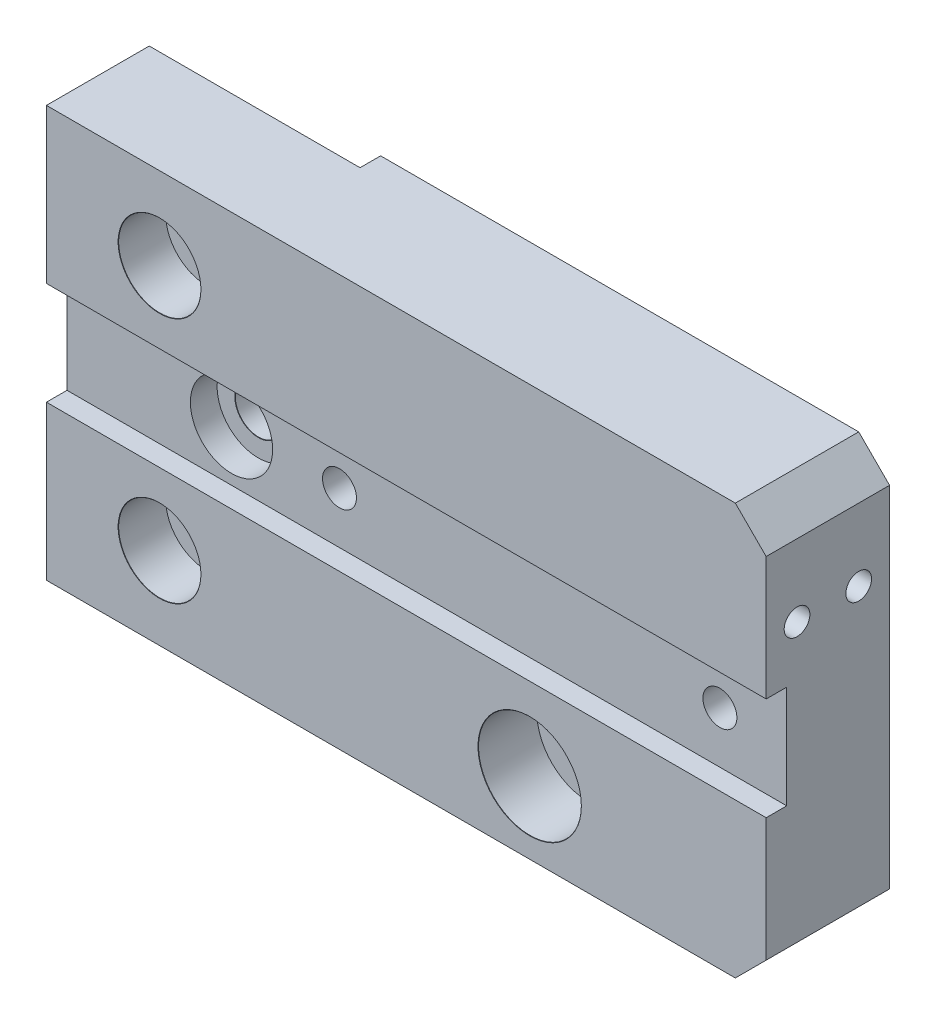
ISO-10303-21;
HEADER;
FILE_DESCRIPTION(('STEP AP214'),'2;1');
FILE_NAME('part.step','',(''),(''),'','','');
FILE_SCHEMA(('AUTOMOTIVE_DESIGN { 1 0 10303 214 1 1 1 1 }'));
ENDSEC;
DATA;
#1=APPLICATION_CONTEXT('core data for automotive mechanical design processes');
#2=APPLICATION_PROTOCOL_DEFINITION('international standard','automotive_design',2000,#1);
#3=PRODUCT_CONTEXT('',#1,'mechanical');
#4=PRODUCT('Part','Part','',(#3));
#5=PRODUCT_RELATED_PRODUCT_CATEGORY('part','',(#4));
#6=PRODUCT_DEFINITION_FORMATION('','',#4);
#7=PRODUCT_DEFINITION_CONTEXT('part definition',#1,'design');
#8=PRODUCT_DEFINITION('design','',#6,#7);
#9=PRODUCT_DEFINITION_SHAPE('','',#8);
#10=(LENGTH_UNIT() NAMED_UNIT(*) SI_UNIT(.MILLI.,.METRE.));
#11=(NAMED_UNIT(*) PLANE_ANGLE_UNIT() SI_UNIT($,.RADIAN.));
#12=(NAMED_UNIT(*) SI_UNIT($,.STERADIAN.) SOLID_ANGLE_UNIT());
#13=UNCERTAINTY_MEASURE_WITH_UNIT(LENGTH_MEASURE(1.E-05),#10,'distance_accuracy_value','');
#14=(GEOMETRIC_REPRESENTATION_CONTEXT(3) GLOBAL_UNCERTAINTY_ASSIGNED_CONTEXT((#13)) GLOBAL_UNIT_ASSIGNED_CONTEXT((#10,
#11,#12)) REPRESENTATION_CONTEXT('',''));
#15=CARTESIAN_POINT('',(0.,0.,0.));
#16=DIRECTION('',(0.,0.,1.));
#17=DIRECTION('',(1.,0.,0.));
#18=AXIS2_PLACEMENT_3D('',#15,#16,#17);
#19=CARTESIAN_POINT('',(0.,0.,12.));
#20=DIRECTION('',(0.,0.,-1.));
#21=DIRECTION('',(-1.,0.,0.));
#22=AXIS2_PLACEMENT_3D('',#19,#20,#21);
#23=PLANE('',#22);
#24=CARTESIAN_POINT('',(6.5,12.,12.));
#25=DIRECTION('',(0.,0.,1.));
#26=DIRECTION('',(1.,0.,0.));
#27=AXIS2_PLACEMENT_3D('',#24,#25,#26);
#28=CIRCLE('',#27,4.025);
#29=CARTESIAN_POINT('',(10.525,12.,12.));
#30=VERTEX_POINT('',#29);
#31=EDGE_CURVE('E229',#30,#30,#28,.T.);
#32=ORIENTED_EDGE('',*,*,#31,.F.);
#33=EDGE_LOOP('',(#32));
#34=FACE_BOUND('',#33,.T.);
#35=DIRECTION('',(0.,1.,0.));
#36=VECTOR('',#35,1.);
#37=CARTESIAN_POINT('',(65.5,-20.,12.));
#38=LINE('',#37,#36);
#39=CARTESIAN_POINT('',(65.5,5.,12.));
#40=VERTEX_POINT('',#39);
#41=CARTESIAN_POINT('',(65.5,17.,12.));
#42=VERTEX_POINT('',#41);
#43=EDGE_CURVE('E272',#40,#42,#38,.T.);
#44=ORIENTED_EDGE('',*,*,#43,.T.);
#45=DIRECTION('',(0.707106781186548,-0.707106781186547,0.));
#46=VECTOR('',#45,1.);
#47=CARTESIAN_POINT('',(62.5,20.,12.));
#48=LINE('',#47,#46);
#49=CARTESIAN_POINT('',(62.5,20.,12.));
#50=VERTEX_POINT('',#49);
#51=EDGE_CURVE('E303',#42,#50,#48,.F.);
#52=ORIENTED_EDGE('',*,*,#51,.T.);
#53=DIRECTION('',(-1.,0.,0.));
#54=VECTOR('',#53,1.);
#55=CARTESIAN_POINT('',(-4.5,20.,12.));
#56=LINE('',#55,#54);
#57=CARTESIAN_POINT('',(-4.5,20.,12.));
#58=VERTEX_POINT('',#57);
#59=EDGE_CURVE('E275',#50,#58,#56,.T.);
#60=ORIENTED_EDGE('',*,*,#59,.T.);
#61=DIRECTION('',(0.,-1.,0.));
#62=VECTOR('',#61,1.);
#63=CARTESIAN_POINT('',(-4.5,-20.,12.));
#64=LINE('',#63,#62);
#65=CARTESIAN_POINT('',(-4.5,5.,12.));
#66=VERTEX_POINT('',#65);
#67=EDGE_CURVE('E266',#58,#66,#64,.T.);
#68=ORIENTED_EDGE('',*,*,#67,.T.);
#69=DIRECTION('',(1.,0.,0.));
#70=VECTOR('',#69,1.);
#71=CARTESIAN_POINT('',(-4.5,5.,12.));
#72=LINE('',#71,#70);
#73=EDGE_CURVE('E159',#66,#40,#72,.T.);
#74=ORIENTED_EDGE('',*,*,#73,.T.);
#75=EDGE_LOOP('',(#44,#52,#60,#68,#74));
#76=FACE_BOUND('',#75,.T.);
#77=ADVANCED_FACE('F16',(#34,#76),#23,.F.);
#78=CARTESIAN_POINT('',(-4.5,-20.,12.));
#79=DIRECTION('',(1.,0.,0.));
#80=DIRECTION('',(0.,0.,-1.));
#81=AXIS2_PLACEMENT_3D('',#78,#79,#80);
#82=PLANE('',#81);
#83=DIRECTION('',(0.,1.,0.));
#84=VECTOR('',#83,1.);
#85=CARTESIAN_POINT('',(-4.5,5.,10.));
#86=LINE('',#85,#84);
#87=CARTESIAN_POINT('',(-4.5,-5.,10.));
#88=VERTEX_POINT('',#87);
#89=CARTESIAN_POINT('',(-4.5,5.,10.));
#90=VERTEX_POINT('',#89);
#91=EDGE_CURVE('E145',#88,#90,#86,.T.);
#92=ORIENTED_EDGE('',*,*,#91,.T.);
#93=DIRECTION('',(0.,0.,1.));
#94=VECTOR('',#93,1.);
#95=CARTESIAN_POINT('',(-4.5,5.,12.));
#96=LINE('',#95,#94);
#97=EDGE_CURVE('E149',#90,#66,#96,.T.);
#98=ORIENTED_EDGE('',*,*,#97,.T.);
#99=ORIENTED_EDGE('',*,*,#67,.F.);
#100=DIRECTION('',(0.,0.,-1.));
#101=VECTOR('',#100,1.);
#102=CARTESIAN_POINT('',(-4.5,20.,12.));
#103=LINE('',#102,#101);
#104=CARTESIAN_POINT('',(-4.5,20.,2.));
#105=VERTEX_POINT('',#104);
#106=EDGE_CURVE('E277',#58,#105,#103,.T.);
#107=ORIENTED_EDGE('',*,*,#106,.T.);
#108=DIRECTION('',(0.,-1.,0.));
#109=VECTOR('',#108,1.);
#110=CARTESIAN_POINT('',(-4.5,20.,2.));
#111=LINE('',#110,#109);
#112=CARTESIAN_POINT('',(-4.5,-20.,2.));
#113=VERTEX_POINT('',#112);
#114=EDGE_CURVE('E259',#105,#113,#111,.T.);
#115=ORIENTED_EDGE('',*,*,#114,.T.);
#116=DIRECTION('',(0.,0.,-1.));
#117=VECTOR('',#116,1.);
#118=CARTESIAN_POINT('',(-4.5,-20.,12.));
#119=LINE('',#118,#117);
#120=CARTESIAN_POINT('',(-4.5,-20.,12.));
#121=VERTEX_POINT('',#120);
#122=EDGE_CURVE('E286',#121,#113,#119,.T.);
#123=ORIENTED_EDGE('',*,*,#122,.F.);
#124=CARTESIAN_POINT('',(-4.5,-5.,12.));
#125=VERTEX_POINT('',#124);
#126=EDGE_CURVE('E270',#125,#121,#64,.T.);
#127=ORIENTED_EDGE('',*,*,#126,.F.);
#128=DIRECTION('',(0.,0.,-1.));
#129=VECTOR('',#128,1.);
#130=CARTESIAN_POINT('',(-4.5,-5.,12.));
#131=LINE('',#130,#129);
#132=EDGE_CURVE('E142',#125,#88,#131,.T.);
#133=ORIENTED_EDGE('',*,*,#132,.T.);
#134=EDGE_LOOP('',(#92,#98,#99,#107,#115,#123,#127,#133));
#135=FACE_BOUND('',#134,.T.);
#136=ADVANCED_FACE('F337',(#135),#82,.F.);
#137=CARTESIAN_POINT('',(-4.5,-20.,12.));
#138=DIRECTION('',(0.,1.,0.));
#139=DIRECTION('',(0.,0.,1.));
#140=AXIS2_PLACEMENT_3D('',#137,#138,#139);
#141=PLANE('',#140);
#142=DIRECTION('',(1.,0.,0.));
#143=VECTOR('',#142,1.);
#144=CARTESIAN_POINT('',(-4.5,-20.,0.));
#145=LINE('',#144,#143);
#146=CARTESIAN_POINT('',(16.,-20.,0.));
#147=VERTEX_POINT('',#146);
#148=CARTESIAN_POINT('',(62.5,-20.,0.));
#149=VERTEX_POINT('',#148);
#150=EDGE_CURVE('E262',#147,#149,#145,.T.);
#151=ORIENTED_EDGE('',*,*,#150,.T.);
#152=DIRECTION('',(0.,0.,1.));
#153=VECTOR('',#152,1.);
#154=CARTESIAN_POINT('',(62.5,-20.,12.));
#155=LINE('',#154,#153);
#156=CARTESIAN_POINT('',(62.5,-20.,12.));
#157=VERTEX_POINT('',#156);
#158=EDGE_CURVE('E24',#149,#157,#155,.T.);
#159=ORIENTED_EDGE('',*,*,#158,.T.);
#160=DIRECTION('',(1.,0.,0.));
#161=VECTOR('',#160,1.);
#162=CARTESIAN_POINT('',(-4.5,-20.,12.));
#163=LINE('',#162,#161);
#164=EDGE_CURVE('E269',#121,#157,#163,.T.);
#165=ORIENTED_EDGE('',*,*,#164,.F.);
#166=ORIENTED_EDGE('',*,*,#122,.T.);
#167=DIRECTION('',(-1.,0.,0.));
#168=VECTOR('',#167,1.);
#169=CARTESIAN_POINT('',(-4.5,-20.,2.));
#170=LINE('',#169,#168);
#171=CARTESIAN_POINT('',(16.,-20.,2.));
#172=VERTEX_POINT('',#171);
#173=EDGE_CURVE('E252',#172,#113,#170,.T.);
#174=ORIENTED_EDGE('',*,*,#173,.F.);
#175=DIRECTION('',(0.,0.,1.));
#176=VECTOR('',#175,1.);
#177=CARTESIAN_POINT('',(16.,-20.,0.));
#178=LINE('',#177,#176);
#179=EDGE_CURVE('E247',#147,#172,#178,.T.);
#180=ORIENTED_EDGE('',*,*,#179,.F.);
#181=EDGE_LOOP('',(#151,#159,#165,#166,#174,#180));
#182=FACE_BOUND('',#181,.T.);
#183=ADVANCED_FACE('F329',(#182),#141,.F.);
#184=CARTESIAN_POINT('',(65.5,-20.,12.));
#185=DIRECTION('',(-1.,0.,0.));
#186=DIRECTION('',(0.,0.,1.));
#187=AXIS2_PLACEMENT_3D('',#184,#185,#186);
#188=PLANE('',#187);
#189=CARTESIAN_POINT('',(65.5,10.,3.));
#190=DIRECTION('',(1.,0.,0.));
#191=DIRECTION('',(0.,0.,-1.));
#192=AXIS2_PLACEMENT_3D('',#189,#190,#191);
#193=CIRCLE('',#192,1.25);
#194=CARTESIAN_POINT('',(65.5,10.,1.75));
#195=VERTEX_POINT('',#194);
#196=EDGE_CURVE('E119',#195,#195,#193,.T.);
#197=ORIENTED_EDGE('',*,*,#196,.F.);
#198=EDGE_LOOP('',(#197));
#199=FACE_BOUND('',#198,.T.);
#200=CARTESIAN_POINT('',(65.5,10.,9.));
#201=DIRECTION('',(1.,0.,0.));
#202=DIRECTION('',(0.,0.,-1.));
#203=AXIS2_PLACEMENT_3D('',#200,#201,#202);
#204=CIRCLE('',#203,1.25);
#205=CARTESIAN_POINT('',(65.5,10.,7.75));
#206=VERTEX_POINT('',#205);
#207=EDGE_CURVE('E118',#206,#206,#204,.T.);
#208=ORIENTED_EDGE('',*,*,#207,.F.);
#209=EDGE_LOOP('',(#208));
#210=FACE_BOUND('',#209,.T.);
#211=DIRECTION('',(0.,1.,0.));
#212=VECTOR('',#211,1.);
#213=CARTESIAN_POINT('',(65.5,-20.,0.));
#214=LINE('',#213,#212);
#215=CARTESIAN_POINT('',(65.5,-17.,0.));
#216=VERTEX_POINT('',#215);
#217=CARTESIAN_POINT('',(65.5,17.,0.));
#218=VERTEX_POINT('',#217);
#219=EDGE_CURVE('E279',#216,#218,#214,.T.);
#220=ORIENTED_EDGE('',*,*,#219,.T.);
#221=DIRECTION('',(0.,0.,1.));
#222=VECTOR('',#221,1.);
#223=CARTESIAN_POINT('',(65.5,17.,12.));
#224=LINE('',#223,#222);
#225=EDGE_CURVE('E301',#218,#42,#224,.T.);
#226=ORIENTED_EDGE('',*,*,#225,.T.);
#227=ORIENTED_EDGE('',*,*,#43,.F.);
#228=DIRECTION('',(0.,0.,1.));
#229=VECTOR('',#228,1.);
#230=CARTESIAN_POINT('',(65.5,5.,12.));
#231=LINE('',#230,#229);
#232=CARTESIAN_POINT('',(65.5,5.,10.));
#233=VERTEX_POINT('',#232);
#234=EDGE_CURVE('E146',#233,#40,#231,.T.);
#235=ORIENTED_EDGE('',*,*,#234,.F.);
#236=DIRECTION('',(0.,1.,0.));
#237=VECTOR('',#236,1.);
#238=CARTESIAN_POINT('',(65.5,5.,10.));
#239=LINE('',#238,#237);
#240=CARTESIAN_POINT('',(65.5,-5.,10.));
#241=VERTEX_POINT('',#240);
#242=EDGE_CURVE('E155',#241,#233,#239,.T.);
#243=ORIENTED_EDGE('',*,*,#242,.F.);
#244=DIRECTION('',(0.,0.,-1.));
#245=VECTOR('',#244,1.);
#246=CARTESIAN_POINT('',(65.5,-5.,12.));
#247=LINE('',#246,#245);
#248=CARTESIAN_POINT('',(65.5,-5.,12.));
#249=VERTEX_POINT('',#248);
#250=EDGE_CURVE('E141',#249,#241,#247,.T.);
#251=ORIENTED_EDGE('',*,*,#250,.F.);
#252=CARTESIAN_POINT('',(65.5,-17.,12.));
#253=VERTEX_POINT('',#252);
#254=EDGE_CURVE('E273',#253,#249,#38,.T.);
#255=ORIENTED_EDGE('',*,*,#254,.F.);
#256=DIRECTION('',(0.,0.,-1.));
#257=VECTOR('',#256,1.);
#258=CARTESIAN_POINT('',(65.5,-17.,12.));
#259=LINE('',#258,#257);
#260=EDGE_CURVE('E298',#253,#216,#259,.T.);
#261=ORIENTED_EDGE('',*,*,#260,.T.);
#262=EDGE_LOOP('',(#220,#226,#227,#235,#243,#251,#255,#261));
#263=FACE_BOUND('',#262,.T.);
#264=ADVANCED_FACE('F323',(#199,#210,#263),#188,.F.);
#265=CARTESIAN_POINT('',(-4.5,20.,12.));
#266=DIRECTION('',(0.,-1.,0.));
#267=DIRECTION('',(0.,0.,-1.));
#268=AXIS2_PLACEMENT_3D('',#265,#266,#267);
#269=PLANE('',#268);
#270=ORIENTED_EDGE('',*,*,#59,.F.);
#271=DIRECTION('',(0.,0.,-1.));
#272=VECTOR('',#271,1.);
#273=CARTESIAN_POINT('',(62.5,20.,12.));
#274=LINE('',#273,#272);
#275=CARTESIAN_POINT('',(62.5,20.,0.));
#276=VERTEX_POINT('',#275);
#277=EDGE_CURVE('E289',#50,#276,#274,.T.);
#278=ORIENTED_EDGE('',*,*,#277,.T.);
#279=DIRECTION('',(-1.,0.,0.));
#280=VECTOR('',#279,1.);
#281=CARTESIAN_POINT('',(-4.5,20.,0.));
#282=LINE('',#281,#280);
#283=CARTESIAN_POINT('',(16.,20.,0.));
#284=VERTEX_POINT('',#283);
#285=EDGE_CURVE('E282',#276,#284,#282,.T.);
#286=ORIENTED_EDGE('',*,*,#285,.T.);
#287=DIRECTION('',(0.,0.,1.));
#288=VECTOR('',#287,1.);
#289=CARTESIAN_POINT('',(16.,20.,0.));
#290=LINE('',#289,#288);
#291=CARTESIAN_POINT('',(16.,20.,2.));
#292=VERTEX_POINT('',#291);
#293=EDGE_CURVE('E248',#284,#292,#290,.T.);
#294=ORIENTED_EDGE('',*,*,#293,.T.);
#295=DIRECTION('',(-1.,0.,0.));
#296=VECTOR('',#295,1.);
#297=CARTESIAN_POINT('',(-4.5,20.,2.));
#298=LINE('',#297,#296);
#299=EDGE_CURVE('E251',#292,#105,#298,.T.);
#300=ORIENTED_EDGE('',*,*,#299,.T.);
#301=ORIENTED_EDGE('',*,*,#106,.F.);
#302=EDGE_LOOP('',(#270,#278,#286,#294,#300,#301));
#303=FACE_BOUND('',#302,.T.);
#304=ADVANCED_FACE('F314',(#303),#269,.F.);
#305=CARTESIAN_POINT('',(42.5,-13.,12.));
#306=DIRECTION('',(0.,0.,1.));
#307=DIRECTION('',(1.,0.,0.));
#308=AXIS2_PLACEMENT_3D('',#305,#306,#307);
#309=CIRCLE('',#308,5.025);
#310=CARTESIAN_POINT('',(47.525,-13.,12.));
#311=VERTEX_POINT('',#310);
#312=EDGE_CURVE('E172',#311,#311,#309,.T.);
#313=ORIENTED_EDGE('',*,*,#312,.F.);
#314=EDGE_LOOP('',(#313));
#315=FACE_BOUND('',#314,.T.);
#316=CARTESIAN_POINT('',(6.5,-12.,12.));
#317=DIRECTION('',(0.,0.,1.));
#318=DIRECTION('',(1.,0.,0.));
#319=AXIS2_PLACEMENT_3D('',#316,#317,#318);
#320=CIRCLE('',#319,4.025);
#321=CARTESIAN_POINT('',(10.525,-12.,12.));
#322=VERTEX_POINT('',#321);
#323=EDGE_CURVE('E193',#322,#322,#320,.T.);
#324=ORIENTED_EDGE('',*,*,#323,.F.);
#325=EDGE_LOOP('',(#324));
#326=FACE_BOUND('',#325,.T.);
#327=ORIENTED_EDGE('',*,*,#164,.T.);
#328=DIRECTION('',(-0.707106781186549,-0.707106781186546,0.));
#329=VECTOR('',#328,1.);
#330=CARTESIAN_POINT('',(65.5,-17.,12.));
#331=LINE('',#330,#329);
#332=EDGE_CURVE('E11',#157,#253,#331,.F.);
#333=ORIENTED_EDGE('',*,*,#332,.T.);
#334=ORIENTED_EDGE('',*,*,#254,.T.);
#335=DIRECTION('',(1.,0.,0.));
#336=VECTOR('',#335,1.);
#337=CARTESIAN_POINT('',(-4.5,-5.,12.));
#338=LINE('',#337,#336);
#339=EDGE_CURVE('E152',#125,#249,#338,.T.);
#340=ORIENTED_EDGE('',*,*,#339,.F.);
#341=ORIENTED_EDGE('',*,*,#126,.T.);
#342=EDGE_LOOP('',(#327,#333,#334,#340,#341));
#343=FACE_BOUND('',#342,.T.);
#344=ADVANCED_FACE('F352',(#315,#326,#343),#23,.F.);
#345=CARTESIAN_POINT('',(0.,0.,0.));
#346=DIRECTION('',(0.,0.,-1.));
#347=DIRECTION('',(-1.,0.,0.));
#348=AXIS2_PLACEMENT_3D('',#345,#346,#347);
#349=PLANE('',#348);
#350=CARTESIAN_POINT('',(59.,0.,0.));
#351=DIRECTION('',(0.,0.,1.));
#352=DIRECTION('',(1.,0.,0.));
#353=AXIS2_PLACEMENT_3D('',#350,#351,#352);
#354=CIRCLE('',#353,1.65);
#355=CARTESIAN_POINT('',(60.65,0.,0.));
#356=VERTEX_POINT('',#355);
#357=EDGE_CURVE('E132',#356,#356,#354,.T.);
#358=ORIENTED_EDGE('',*,*,#357,.T.);
#359=EDGE_LOOP('',(#358));
#360=FACE_BOUND('',#359,.T.);
#361=CARTESIAN_POINT('',(22.,0.,0.));
#362=DIRECTION('',(0.,0.,1.));
#363=DIRECTION('',(1.,0.,0.));
#364=AXIS2_PLACEMENT_3D('',#361,#362,#363);
#365=CIRCLE('',#364,1.65);
#366=CARTESIAN_POINT('',(23.65,0.,0.));
#367=VERTEX_POINT('',#366);
#368=EDGE_CURVE('E138',#367,#367,#365,.T.);
#369=ORIENTED_EDGE('',*,*,#368,.T.);
#370=EDGE_LOOP('',(#369));
#371=FACE_BOUND('',#370,.T.);
#372=CARTESIAN_POINT('',(42.5,-13.,0.));
#373=DIRECTION('',(0.,0.,1.));
#374=DIRECTION('',(1.,0.,0.));
#375=AXIS2_PLACEMENT_3D('',#372,#373,#374);
#376=CIRCLE('',#375,2.775);
#377=CARTESIAN_POINT('',(45.275,-13.,0.));
#378=VERTEX_POINT('',#377);
#379=EDGE_CURVE('E169',#378,#378,#376,.T.);
#380=ORIENTED_EDGE('',*,*,#379,.T.);
#381=EDGE_LOOP('',(#380));
#382=FACE_BOUND('',#381,.T.);
#383=ORIENTED_EDGE('',*,*,#285,.F.);
#384=DIRECTION('',(-0.707106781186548,0.707106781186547,0.));
#385=VECTOR('',#384,1.);
#386=CARTESIAN_POINT('',(41.25,41.25,0.));
#387=LINE('',#386,#385);
#388=EDGE_CURVE('E296',#276,#218,#387,.F.);
#389=ORIENTED_EDGE('',*,*,#388,.T.);
#390=ORIENTED_EDGE('',*,*,#219,.F.);
#391=DIRECTION('',(0.707106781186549,0.707106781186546,0.));
#392=VECTOR('',#391,1.);
#393=CARTESIAN_POINT('',(41.25,-41.25,0.));
#394=LINE('',#393,#392);
#395=EDGE_CURVE('E294',#216,#149,#394,.F.);
#396=ORIENTED_EDGE('',*,*,#395,.T.);
#397=ORIENTED_EDGE('',*,*,#150,.F.);
#398=DIRECTION('',(0.,-1.,0.));
#399=VECTOR('',#398,1.);
#400=CARTESIAN_POINT('',(16.,20.,0.));
#401=LINE('',#400,#399);
#402=EDGE_CURVE('E255',#284,#147,#401,.T.);
#403=ORIENTED_EDGE('',*,*,#402,.F.);
#404=EDGE_LOOP('',(#383,#389,#390,#396,#397,#403));
#405=FACE_BOUND('',#404,.T.);
#406=ADVANCED_FACE('F320',(#360,#371,#382,#405),#349,.T.);
#407=CARTESIAN_POINT('',(-4.5,20.,2.));
#408=DIRECTION('',(0.,0.,1.));
#409=DIRECTION('',(1.,0.,0.));
#410=AXIS2_PLACEMENT_3D('',#407,#408,#409);
#411=PLANE('',#410);
#412=CARTESIAN_POINT('',(6.5,-12.,2.));
#413=DIRECTION('',(0.,0.,1.));
#414=DIRECTION('',(1.,0.,0.));
#415=AXIS2_PLACEMENT_3D('',#412,#413,#414);
#416=CIRCLE('',#415,2.275);
#417=CARTESIAN_POINT('',(8.775,-12.,2.));
#418=VERTEX_POINT('',#417);
#419=EDGE_CURVE('E190',#418,#418,#416,.T.);
#420=ORIENTED_EDGE('',*,*,#419,.T.);
#421=EDGE_LOOP('',(#420));
#422=FACE_BOUND('',#421,.T.);
#423=CARTESIAN_POINT('',(11.5,0.,2.));
#424=DIRECTION('',(0.,0.,1.));
#425=DIRECTION('',(1.,0.,0.));
#426=AXIS2_PLACEMENT_3D('',#423,#424,#425);
#427=CIRCLE('',#426,2.275);
#428=CARTESIAN_POINT('',(13.775,0.,2.));
#429=VERTEX_POINT('',#428);
#430=EDGE_CURVE('E211',#429,#429,#427,.T.);
#431=ORIENTED_EDGE('',*,*,#430,.T.);
#432=EDGE_LOOP('',(#431));
#433=FACE_BOUND('',#432,.T.);
#434=CARTESIAN_POINT('',(6.5,12.,2.));
#435=DIRECTION('',(0.,0.,1.));
#436=DIRECTION('',(1.,0.,0.));
#437=AXIS2_PLACEMENT_3D('',#434,#435,#436);
#438=CIRCLE('',#437,2.275);
#439=CARTESIAN_POINT('',(8.775,12.,2.));
#440=VERTEX_POINT('',#439);
#441=EDGE_CURVE('E226',#440,#440,#438,.T.);
#442=ORIENTED_EDGE('',*,*,#441,.T.);
#443=EDGE_LOOP('',(#442));
#444=FACE_BOUND('',#443,.T.);
#445=ORIENTED_EDGE('',*,*,#173,.T.);
#446=ORIENTED_EDGE('',*,*,#114,.F.);
#447=ORIENTED_EDGE('',*,*,#299,.F.);
#448=DIRECTION('',(0.,-1.,0.));
#449=VECTOR('',#448,1.);
#450=CARTESIAN_POINT('',(16.,20.,2.));
#451=LINE('',#450,#449);
#452=EDGE_CURVE('E263',#292,#172,#451,.T.);
#453=ORIENTED_EDGE('',*,*,#452,.T.);
#454=EDGE_LOOP('',(#445,#446,#447,#453));
#455=FACE_BOUND('',#454,.T.);
#456=ADVANCED_FACE('F362',(#422,#433,#444,#455),#411,.F.);
#457=CARTESIAN_POINT('',(16.,20.,0.));
#458=DIRECTION('',(1.,0.,0.));
#459=DIRECTION('',(0.,0.,-1.));
#460=AXIS2_PLACEMENT_3D('',#457,#458,#459);
#461=PLANE('',#460);
#462=ORIENTED_EDGE('',*,*,#179,.T.);
#463=ORIENTED_EDGE('',*,*,#452,.F.);
#464=ORIENTED_EDGE('',*,*,#293,.F.);
#465=ORIENTED_EDGE('',*,*,#402,.T.);
#466=EDGE_LOOP('',(#462,#463,#464,#465));
#467=FACE_BOUND('',#466,.T.);
#468=ADVANCED_FACE('F332',(#467),#461,.F.);
#469=CARTESIAN_POINT('',(6.5,12.,2.025));
#470=DIRECTION('',(0.,0.,-1.));
#471=DIRECTION('',(-1.,0.,0.));
#472=AXIS2_PLACEMENT_3D('',#469,#470,#471);
#473=CONICAL_SURFACE('',#472,2.25,0.785398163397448);
#474=ORIENTED_EDGE('',*,*,#441,.F.);
#475=EDGE_LOOP('',(#474));
#476=FACE_BOUND('',#475,.T.);
#477=CARTESIAN_POINT('',(6.5,12.,2.025));
#478=DIRECTION('',(0.,0.,1.));
#479=DIRECTION('',(1.,0.,0.));
#480=AXIS2_PLACEMENT_3D('',#477,#478,#479);
#481=CIRCLE('',#480,2.25);
#482=CARTESIAN_POINT('',(8.75,12.,2.025));
#483=VERTEX_POINT('',#482);
#484=EDGE_CURVE('E244',#483,#483,#481,.T.);
#485=ORIENTED_EDGE('',*,*,#484,.T.);
#486=EDGE_LOOP('',(#485));
#487=FACE_BOUND('',#486,.T.);
#488=ADVANCED_FACE('F408',(#476,#487),#473,.F.);
#489=CARTESIAN_POINT('',(6.5,12.,12.));
#490=DIRECTION('',(0.,0.,1.));
#491=DIRECTION('',(1.,0.,0.));
#492=AXIS2_PLACEMENT_3D('',#489,#490,#491);
#493=CYLINDRICAL_SURFACE('',#492,2.25);
#494=ORIENTED_EDGE('',*,*,#484,.F.);
#495=EDGE_LOOP('',(#494));
#496=FACE_BOUND('',#495,.T.);
#497=CARTESIAN_POINT('',(6.5,12.,7.375));
#498=DIRECTION('',(0.,0.,1.));
#499=DIRECTION('',(1.,0.,0.));
#500=AXIS2_PLACEMENT_3D('',#497,#498,#499);
#501=CIRCLE('',#500,2.25);
#502=CARTESIAN_POINT('',(8.75,12.,7.375));
#503=VERTEX_POINT('',#502);
#504=EDGE_CURVE('E241',#503,#503,#501,.T.);
#505=ORIENTED_EDGE('',*,*,#504,.T.);
#506=EDGE_LOOP('',(#505));
#507=FACE_BOUND('',#506,.T.);
#508=ADVANCED_FACE('F404',(#496,#507),#493,.F.);
#509=CARTESIAN_POINT('',(6.5,12.,7.4));
#510=DIRECTION('',(0.,0.,1.));
#511=DIRECTION('',(1.,0.,0.));
#512=AXIS2_PLACEMENT_3D('',#509,#510,#511);
#513=CONICAL_SURFACE('',#512,2.275,0.785398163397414);
#514=ORIENTED_EDGE('',*,*,#504,.F.);
#515=EDGE_LOOP('',(#514));
#516=FACE_BOUND('',#515,.T.);
#517=CARTESIAN_POINT('',(6.5,12.,7.4));
#518=DIRECTION('',(0.,0.,1.));
#519=DIRECTION('',(1.,0.,0.));
#520=AXIS2_PLACEMENT_3D('',#517,#518,#519);
#521=CIRCLE('',#520,2.275);
#522=CARTESIAN_POINT('',(8.775,12.,7.4));
#523=VERTEX_POINT('',#522);
#524=EDGE_CURVE('E238',#523,#523,#521,.T.);
#525=ORIENTED_EDGE('',*,*,#524,.T.);
#526=EDGE_LOOP('',(#525));
#527=FACE_BOUND('',#526,.T.);
#528=ADVANCED_FACE('F400',(#516,#527),#513,.F.);
#529=CARTESIAN_POINT('',(8.775,12.,7.4));
#530=DIRECTION('',(0.,0.,-1.));
#531=DIRECTION('',(-1.,0.,0.));
#532=AXIS2_PLACEMENT_3D('',#529,#530,#531);
#533=PLANE('',#532);
#534=ORIENTED_EDGE('',*,*,#524,.F.);
#535=EDGE_LOOP('',(#534));
#536=FACE_BOUND('',#535,.T.);
#537=CARTESIAN_POINT('',(6.5,12.,7.4));
#538=DIRECTION('',(0.,0.,1.));
#539=DIRECTION('',(1.,0.,0.));
#540=AXIS2_PLACEMENT_3D('',#537,#538,#539);
#541=CIRCLE('',#540,4.);
#542=CARTESIAN_POINT('',(10.5,12.,7.4));
#543=VERTEX_POINT('',#542);
#544=EDGE_CURVE('E235',#543,#543,#541,.T.);
#545=ORIENTED_EDGE('',*,*,#544,.T.);
#546=EDGE_LOOP('',(#545));
#547=FACE_BOUND('',#546,.T.);
#548=ADVANCED_FACE('F392',(#536,#547),#533,.F.);
#549=CARTESIAN_POINT('',(6.5,12.,12.));
#550=DIRECTION('',(0.,0.,1.));
#551=DIRECTION('',(1.,0.,0.));
#552=AXIS2_PLACEMENT_3D('',#549,#550,#551);
#553=CYLINDRICAL_SURFACE('',#552,4.);
#554=ORIENTED_EDGE('',*,*,#544,.F.);
#555=EDGE_LOOP('',(#554));
#556=FACE_BOUND('',#555,.T.);
#557=CARTESIAN_POINT('',(6.5,12.,11.975));
#558=DIRECTION('',(0.,0.,1.));
#559=DIRECTION('',(1.,0.,0.));
#560=AXIS2_PLACEMENT_3D('',#557,#558,#559);
#561=CIRCLE('',#560,4.);
#562=CARTESIAN_POINT('',(10.5,12.,11.975));
#563=VERTEX_POINT('',#562);
#564=EDGE_CURVE('E232',#563,#563,#561,.T.);
#565=ORIENTED_EDGE('',*,*,#564,.T.);
#566=EDGE_LOOP('',(#565));
#567=FACE_BOUND('',#566,.T.);
#568=ADVANCED_FACE('F381',(#556,#567),#553,.F.);
#569=CARTESIAN_POINT('',(6.5,12.,12.));
#570=DIRECTION('',(0.,0.,1.));
#571=DIRECTION('',(1.,0.,0.));
#572=AXIS2_PLACEMENT_3D('',#569,#570,#571);
#573=CONICAL_SURFACE('',#572,4.025,0.785398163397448);
#574=ORIENTED_EDGE('',*,*,#564,.F.);
#575=EDGE_LOOP('',(#574));
#576=FACE_BOUND('',#575,.T.);
#577=ORIENTED_EDGE('',*,*,#31,.T.);
#578=EDGE_LOOP('',(#577));
#579=FACE_BOUND('',#578,.T.);
#580=ADVANCED_FACE('F378',(#576,#579),#573,.F.);
#581=CARTESIAN_POINT('',(11.5,0.,2.025));
#582=DIRECTION('',(0.,0.,-1.));
#583=DIRECTION('',(-1.,0.,0.));
#584=AXIS2_PLACEMENT_3D('',#581,#582,#583);
#585=CONICAL_SURFACE('',#584,2.25,0.785398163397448);
#586=ORIENTED_EDGE('',*,*,#430,.F.);
#587=EDGE_LOOP('',(#586));
#588=FACE_BOUND('',#587,.T.);
#589=CARTESIAN_POINT('',(11.5,0.,2.025));
#590=DIRECTION('',(0.,0.,1.));
#591=DIRECTION('',(1.,0.,0.));
#592=AXIS2_PLACEMENT_3D('',#589,#590,#591);
#593=CIRCLE('',#592,2.25);
#594=CARTESIAN_POINT('',(13.75,0.,2.025));
#595=VERTEX_POINT('',#594);
#596=EDGE_CURVE('E223',#595,#595,#593,.T.);
#597=ORIENTED_EDGE('',*,*,#596,.T.);
#598=EDGE_LOOP('',(#597));
#599=FACE_BOUND('',#598,.T.);
#600=ADVANCED_FACE('F380',(#588,#599),#585,.F.);
#601=CARTESIAN_POINT('',(11.5,0.,12.));
#602=DIRECTION('',(0.,0.,1.));
#603=DIRECTION('',(1.,0.,0.));
#604=AXIS2_PLACEMENT_3D('',#601,#602,#603);
#605=CYLINDRICAL_SURFACE('',#604,2.25);
#606=ORIENTED_EDGE('',*,*,#596,.F.);
#607=EDGE_LOOP('',(#606));
#608=FACE_BOUND('',#607,.T.);
#609=CARTESIAN_POINT('',(11.5,0.,7.375));
#610=DIRECTION('',(0.,0.,1.));
#611=DIRECTION('',(1.,0.,0.));
#612=AXIS2_PLACEMENT_3D('',#609,#610,#611);
#613=CIRCLE('',#612,2.25);
#614=CARTESIAN_POINT('',(13.75,0.,7.375));
#615=VERTEX_POINT('',#614);
#616=EDGE_CURVE('E220',#615,#615,#613,.T.);
#617=ORIENTED_EDGE('',*,*,#616,.T.);
#618=EDGE_LOOP('',(#617));
#619=FACE_BOUND('',#618,.T.);
#620=ADVANCED_FACE('F389',(#608,#619),#605,.F.);
#621=CARTESIAN_POINT('',(11.5,0.,7.4));
#622=DIRECTION('',(0.,0.,1.));
#623=DIRECTION('',(1.,0.,0.));
#624=AXIS2_PLACEMENT_3D('',#621,#622,#623);
#625=CONICAL_SURFACE('',#624,2.275,0.785398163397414);
#626=ORIENTED_EDGE('',*,*,#616,.F.);
#627=EDGE_LOOP('',(#626));
#628=FACE_BOUND('',#627,.T.);
#629=CARTESIAN_POINT('',(11.5,0.,7.4));
#630=DIRECTION('',(0.,0.,1.));
#631=DIRECTION('',(1.,0.,0.));
#632=AXIS2_PLACEMENT_3D('',#629,#630,#631);
#633=CIRCLE('',#632,2.275);
#634=CARTESIAN_POINT('',(13.775,0.,7.4));
#635=VERTEX_POINT('',#634);
#636=EDGE_CURVE('E217',#635,#635,#633,.T.);
#637=ORIENTED_EDGE('',*,*,#636,.T.);
#638=EDGE_LOOP('',(#637));
#639=FACE_BOUND('',#638,.T.);
#640=ADVANCED_FACE('F469',(#628,#639),#625,.F.);
#641=CARTESIAN_POINT('',(13.775,0.,7.4));
#642=DIRECTION('',(0.,0.,-1.));
#643=DIRECTION('',(-1.,0.,0.));
#644=AXIS2_PLACEMENT_3D('',#641,#642,#643);
#645=PLANE('',#644);
#646=ORIENTED_EDGE('',*,*,#636,.F.);
#647=EDGE_LOOP('',(#646));
#648=FACE_BOUND('',#647,.T.);
#649=CARTESIAN_POINT('',(11.5,0.,7.4));
#650=DIRECTION('',(0.,0.,1.));
#651=DIRECTION('',(1.,0.,0.));
#652=AXIS2_PLACEMENT_3D('',#649,#650,#651);
#653=CIRCLE('',#652,4.);
#654=CARTESIAN_POINT('',(15.5,0.,7.4));
#655=VERTEX_POINT('',#654);
#656=EDGE_CURVE('E214',#655,#655,#653,.T.);
#657=ORIENTED_EDGE('',*,*,#656,.T.);
#658=EDGE_LOOP('',(#657));
#659=FACE_BOUND('',#658,.T.);
#660=ADVANCED_FACE('F478',(#648,#659),#645,.F.);
#661=CARTESIAN_POINT('',(11.5,0.,12.));
#662=DIRECTION('',(0.,0.,1.));
#663=DIRECTION('',(1.,0.,0.));
#664=AXIS2_PLACEMENT_3D('',#661,#662,#663);
#665=CYLINDRICAL_SURFACE('',#664,4.);
#666=CARTESIAN_POINT('',(11.5,0.,10.));
#667=DIRECTION('',(0.,0.,-1.));
#668=DIRECTION('',(-1.,0.,0.));
#669=AXIS2_PLACEMENT_3D('',#666,#667,#668);
#670=CIRCLE('',#669,4.);
#671=CARTESIAN_POINT('',(7.5,0.,10.));
#672=VERTEX_POINT('',#671);
#673=EDGE_CURVE('E162',#672,#672,#670,.F.);
#674=ORIENTED_EDGE('',*,*,#673,.T.);
#675=EDGE_LOOP('',(#674));
#676=FACE_BOUND('',#675,.T.);
#677=ORIENTED_EDGE('',*,*,#656,.F.);
#678=EDGE_LOOP('',(#677));
#679=FACE_BOUND('',#678,.T.);
#680=ADVANCED_FACE('F488',(#676,#679),#665,.F.);
#681=CARTESIAN_POINT('',(6.5,-12.,2.025));
#682=DIRECTION('',(0.,0.,-1.));
#683=DIRECTION('',(-1.,0.,0.));
#684=AXIS2_PLACEMENT_3D('',#681,#682,#683);
#685=CONICAL_SURFACE('',#684,2.25,0.785398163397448);
#686=ORIENTED_EDGE('',*,*,#419,.F.);
#687=EDGE_LOOP('',(#686));
#688=FACE_BOUND('',#687,.T.);
#689=CARTESIAN_POINT('',(6.5,-12.,2.025));
#690=DIRECTION('',(0.,0.,1.));
#691=DIRECTION('',(1.,0.,0.));
#692=AXIS2_PLACEMENT_3D('',#689,#690,#691);
#693=CIRCLE('',#692,2.25);
#694=CARTESIAN_POINT('',(8.75,-12.,2.025));
#695=VERTEX_POINT('',#694);
#696=EDGE_CURVE('E208',#695,#695,#693,.T.);
#697=ORIENTED_EDGE('',*,*,#696,.T.);
#698=EDGE_LOOP('',(#697));
#699=FACE_BOUND('',#698,.T.);
#700=ADVANCED_FACE('F498',(#688,#699),#685,.F.);
#701=CARTESIAN_POINT('',(6.5,-12.,12.));
#702=DIRECTION('',(0.,0.,1.));
#703=DIRECTION('',(1.,0.,0.));
#704=AXIS2_PLACEMENT_3D('',#701,#702,#703);
#705=CYLINDRICAL_SURFACE('',#704,2.25);
#706=ORIENTED_EDGE('',*,*,#696,.F.);
#707=EDGE_LOOP('',(#706));
#708=FACE_BOUND('',#707,.T.);
#709=CARTESIAN_POINT('',(6.5,-12.,7.375));
#710=DIRECTION('',(0.,0.,1.));
#711=DIRECTION('',(1.,0.,0.));
#712=AXIS2_PLACEMENT_3D('',#709,#710,#711);
#713=CIRCLE('',#712,2.25);
#714=CARTESIAN_POINT('',(8.75,-12.,7.375));
#715=VERTEX_POINT('',#714);
#716=EDGE_CURVE('E205',#715,#715,#713,.T.);
#717=ORIENTED_EDGE('',*,*,#716,.T.);
#718=EDGE_LOOP('',(#717));
#719=FACE_BOUND('',#718,.T.);
#720=ADVANCED_FACE('F508',(#708,#719),#705,.F.);
#721=CARTESIAN_POINT('',(6.5,-12.,7.4));
#722=DIRECTION('',(0.,0.,1.));
#723=DIRECTION('',(1.,0.,0.));
#724=AXIS2_PLACEMENT_3D('',#721,#722,#723);
#725=CONICAL_SURFACE('',#724,2.275,0.785398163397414);
#726=ORIENTED_EDGE('',*,*,#716,.F.);
#727=EDGE_LOOP('',(#726));
#728=FACE_BOUND('',#727,.T.);
#729=CARTESIAN_POINT('',(6.5,-12.,7.4));
#730=DIRECTION('',(0.,0.,1.));
#731=DIRECTION('',(1.,0.,0.));
#732=AXIS2_PLACEMENT_3D('',#729,#730,#731);
#733=CIRCLE('',#732,2.275);
#734=CARTESIAN_POINT('',(8.775,-12.,7.4));
#735=VERTEX_POINT('',#734);
#736=EDGE_CURVE('E202',#735,#735,#733,.T.);
#737=ORIENTED_EDGE('',*,*,#736,.T.);
#738=EDGE_LOOP('',(#737));
#739=FACE_BOUND('',#738,.T.);
#740=ADVANCED_FACE('F518',(#728,#739),#725,.F.);
#741=CARTESIAN_POINT('',(8.775,-12.,7.4));
#742=DIRECTION('',(0.,0.,-1.));
#743=DIRECTION('',(-1.,0.,0.));
#744=AXIS2_PLACEMENT_3D('',#741,#742,#743);
#745=PLANE('',#744);
#746=ORIENTED_EDGE('',*,*,#736,.F.);
#747=EDGE_LOOP('',(#746));
#748=FACE_BOUND('',#747,.T.);
#749=CARTESIAN_POINT('',(6.5,-12.,7.4));
#750=DIRECTION('',(0.,0.,1.));
#751=DIRECTION('',(1.,0.,0.));
#752=AXIS2_PLACEMENT_3D('',#749,#750,#751);
#753=CIRCLE('',#752,4.);
#754=CARTESIAN_POINT('',(10.5,-12.,7.4));
#755=VERTEX_POINT('',#754);
#756=EDGE_CURVE('E199',#755,#755,#753,.T.);
#757=ORIENTED_EDGE('',*,*,#756,.T.);
#758=EDGE_LOOP('',(#757));
#759=FACE_BOUND('',#758,.T.);
#760=ADVANCED_FACE('F528',(#748,#759),#745,.F.);
#761=CARTESIAN_POINT('',(6.5,-12.,12.));
#762=DIRECTION('',(0.,0.,1.));
#763=DIRECTION('',(1.,0.,0.));
#764=AXIS2_PLACEMENT_3D('',#761,#762,#763);
#765=CYLINDRICAL_SURFACE('',#764,4.);
#766=ORIENTED_EDGE('',*,*,#756,.F.);
#767=EDGE_LOOP('',(#766));
#768=FACE_BOUND('',#767,.T.);
#769=CARTESIAN_POINT('',(6.5,-12.,11.975));
#770=DIRECTION('',(0.,0.,1.));
#771=DIRECTION('',(1.,0.,0.));
#772=AXIS2_PLACEMENT_3D('',#769,#770,#771);
#773=CIRCLE('',#772,4.);
#774=CARTESIAN_POINT('',(10.5,-12.,11.975));
#775=VERTEX_POINT('',#774);
#776=EDGE_CURVE('E196',#775,#775,#773,.T.);
#777=ORIENTED_EDGE('',*,*,#776,.T.);
#778=EDGE_LOOP('',(#777));
#779=FACE_BOUND('',#778,.T.);
#780=ADVANCED_FACE('F538',(#768,#779),#765,.F.);
#781=CARTESIAN_POINT('',(6.5,-12.,12.));
#782=DIRECTION('',(0.,0.,1.));
#783=DIRECTION('',(1.,0.,0.));
#784=AXIS2_PLACEMENT_3D('',#781,#782,#783);
#785=CONICAL_SURFACE('',#784,4.025,0.785398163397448);
#786=ORIENTED_EDGE('',*,*,#776,.F.);
#787=EDGE_LOOP('',(#786));
#788=FACE_BOUND('',#787,.T.);
#789=ORIENTED_EDGE('',*,*,#323,.T.);
#790=EDGE_LOOP('',(#789));
#791=FACE_BOUND('',#790,.T.);
#792=ADVANCED_FACE('F548',(#788,#791),#785,.F.);
#793=CARTESIAN_POINT('',(42.5,-13.,0.0250000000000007));
#794=DIRECTION('',(0.,0.,-1.));
#795=DIRECTION('',(-1.,0.,0.));
#796=AXIS2_PLACEMENT_3D('',#793,#794,#795);
#797=CONICAL_SURFACE('',#796,2.75,0.785398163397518);
#798=ORIENTED_EDGE('',*,*,#379,.F.);
#799=EDGE_LOOP('',(#798));
#800=FACE_BOUND('',#799,.T.);
#801=CARTESIAN_POINT('',(42.5,-13.,0.0250000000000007));
#802=DIRECTION('',(0.,0.,1.));
#803=DIRECTION('',(1.,0.,0.));
#804=AXIS2_PLACEMENT_3D('',#801,#802,#803);
#805=CIRCLE('',#804,2.75);
#806=CARTESIAN_POINT('',(45.25,-13.,0.0250000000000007));
#807=VERTEX_POINT('',#806);
#808=EDGE_CURVE('E187',#807,#807,#805,.T.);
#809=ORIENTED_EDGE('',*,*,#808,.T.);
#810=EDGE_LOOP('',(#809));
#811=FACE_BOUND('',#810,.T.);
#812=ADVANCED_FACE('F559',(#800,#811),#797,.F.);
#813=CARTESIAN_POINT('',(42.5,-13.,12.));
#814=DIRECTION('',(0.,0.,1.));
#815=DIRECTION('',(1.,0.,0.));
#816=AXIS2_PLACEMENT_3D('',#813,#814,#815);
#817=CYLINDRICAL_SURFACE('',#816,2.75);
#818=ORIENTED_EDGE('',*,*,#808,.F.);
#819=EDGE_LOOP('',(#818));
#820=FACE_BOUND('',#819,.T.);
#821=CARTESIAN_POINT('',(42.5,-13.,6.275));
#822=DIRECTION('',(0.,0.,1.));
#823=DIRECTION('',(1.,0.,0.));
#824=AXIS2_PLACEMENT_3D('',#821,#822,#823);
#825=CIRCLE('',#824,2.75);
#826=CARTESIAN_POINT('',(45.25,-13.,6.275));
#827=VERTEX_POINT('',#826);
#828=EDGE_CURVE('E184',#827,#827,#825,.T.);
#829=ORIENTED_EDGE('',*,*,#828,.T.);
#830=EDGE_LOOP('',(#829));
#831=FACE_BOUND('',#830,.T.);
#832=ADVANCED_FACE('F569',(#820,#831),#817,.F.);
#833=CARTESIAN_POINT('',(42.5,-13.,6.3));
#834=DIRECTION('',(0.,0.,1.));
#835=DIRECTION('',(1.,0.,0.));
#836=AXIS2_PLACEMENT_3D('',#833,#834,#835);
#837=CONICAL_SURFACE('',#836,2.775,0.785398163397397);
#838=ORIENTED_EDGE('',*,*,#828,.F.);
#839=EDGE_LOOP('',(#838));
#840=FACE_BOUND('',#839,.T.);
#841=CARTESIAN_POINT('',(42.5,-13.,6.3));
#842=DIRECTION('',(0.,0.,1.));
#843=DIRECTION('',(1.,0.,0.));
#844=AXIS2_PLACEMENT_3D('',#841,#842,#843);
#845=CIRCLE('',#844,2.775);
#846=CARTESIAN_POINT('',(45.275,-13.,6.3));
#847=VERTEX_POINT('',#846);
#848=EDGE_CURVE('E181',#847,#847,#845,.T.);
#849=ORIENTED_EDGE('',*,*,#848,.T.);
#850=EDGE_LOOP('',(#849));
#851=FACE_BOUND('',#850,.T.);
#852=ADVANCED_FACE('F579',(#840,#851),#837,.F.);
#853=CARTESIAN_POINT('',(45.275,-13.,6.3));
#854=DIRECTION('',(0.,0.,-1.));
#855=DIRECTION('',(-1.,0.,0.));
#856=AXIS2_PLACEMENT_3D('',#853,#854,#855);
#857=PLANE('',#856);
#858=ORIENTED_EDGE('',*,*,#848,.F.);
#859=EDGE_LOOP('',(#858));
#860=FACE_BOUND('',#859,.T.);
#861=CARTESIAN_POINT('',(42.5,-13.,6.3));
#862=DIRECTION('',(0.,0.,1.));
#863=DIRECTION('',(1.,0.,0.));
#864=AXIS2_PLACEMENT_3D('',#861,#862,#863);
#865=CIRCLE('',#864,5.);
#866=CARTESIAN_POINT('',(47.5,-13.,6.3));
#867=VERTEX_POINT('',#866);
#868=EDGE_CURVE('E178',#867,#867,#865,.T.);
#869=ORIENTED_EDGE('',*,*,#868,.T.);
#870=EDGE_LOOP('',(#869));
#871=FACE_BOUND('',#870,.T.);
#872=ADVANCED_FACE('F589',(#860,#871),#857,.F.);
#873=CARTESIAN_POINT('',(42.5,-13.,12.));
#874=DIRECTION('',(0.,0.,1.));
#875=DIRECTION('',(1.,0.,0.));
#876=AXIS2_PLACEMENT_3D('',#873,#874,#875);
#877=CYLINDRICAL_SURFACE('',#876,5.);
#878=ORIENTED_EDGE('',*,*,#868,.F.);
#879=EDGE_LOOP('',(#878));
#880=FACE_BOUND('',#879,.T.);
#881=CARTESIAN_POINT('',(42.5,-13.,11.975));
#882=DIRECTION('',(0.,0.,1.));
#883=DIRECTION('',(1.,0.,0.));
#884=AXIS2_PLACEMENT_3D('',#881,#882,#883);
#885=CIRCLE('',#884,5.);
#886=CARTESIAN_POINT('',(47.5,-13.,11.975));
#887=VERTEX_POINT('',#886);
#888=EDGE_CURVE('E175',#887,#887,#885,.T.);
#889=ORIENTED_EDGE('',*,*,#888,.T.);
#890=EDGE_LOOP('',(#889));
#891=FACE_BOUND('',#890,.T.);
#892=ADVANCED_FACE('F599',(#880,#891),#877,.F.);
#893=CARTESIAN_POINT('',(42.5,-13.,12.));
#894=DIRECTION('',(0.,0.,1.));
#895=DIRECTION('',(1.,0.,0.));
#896=AXIS2_PLACEMENT_3D('',#893,#894,#895);
#897=CONICAL_SURFACE('',#896,5.025,0.785398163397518);
#898=ORIENTED_EDGE('',*,*,#888,.F.);
#899=EDGE_LOOP('',(#898));
#900=FACE_BOUND('',#899,.T.);
#901=ORIENTED_EDGE('',*,*,#312,.T.);
#902=EDGE_LOOP('',(#901));
#903=FACE_BOUND('',#902,.T.);
#904=ADVANCED_FACE('F609',(#900,#903),#897,.F.);
#905=CARTESIAN_POINT('',(-4.5,5.,10.));
#906=DIRECTION('',(0.,0.,-1.));
#907=DIRECTION('',(-1.,0.,0.));
#908=AXIS2_PLACEMENT_3D('',#905,#906,#907);
#909=PLANE('',#908);
#910=CARTESIAN_POINT('',(59.,0.,10.));
#911=DIRECTION('',(0.,0.,1.));
#912=DIRECTION('',(1.,0.,0.));
#913=AXIS2_PLACEMENT_3D('',#910,#911,#912);
#914=CIRCLE('',#913,1.65);
#915=CARTESIAN_POINT('',(60.65,0.,10.));
#916=VERTEX_POINT('',#915);
#917=EDGE_CURVE('E129',#916,#916,#914,.T.);
#918=ORIENTED_EDGE('',*,*,#917,.F.);
#919=EDGE_LOOP('',(#918));
#920=FACE_BOUND('',#919,.T.);
#921=CARTESIAN_POINT('',(22.,0.,10.));
#922=DIRECTION('',(0.,0.,1.));
#923=DIRECTION('',(1.,0.,0.));
#924=AXIS2_PLACEMENT_3D('',#921,#922,#923);
#925=CIRCLE('',#924,1.65);
#926=CARTESIAN_POINT('',(23.65,0.,10.));
#927=VERTEX_POINT('',#926);
#928=EDGE_CURVE('E135',#927,#927,#925,.T.);
#929=ORIENTED_EDGE('',*,*,#928,.F.);
#930=EDGE_LOOP('',(#929));
#931=FACE_BOUND('',#930,.T.);
#932=ORIENTED_EDGE('',*,*,#242,.T.);
#933=DIRECTION('',(1.,0.,0.));
#934=VECTOR('',#933,1.);
#935=CARTESIAN_POINT('',(-4.5,5.,10.));
#936=LINE('',#935,#934);
#937=EDGE_CURVE('E163',#90,#233,#936,.T.);
#938=ORIENTED_EDGE('',*,*,#937,.F.);
#939=ORIENTED_EDGE('',*,*,#91,.F.);
#940=DIRECTION('',(1.,0.,0.));
#941=VECTOR('',#940,1.);
#942=CARTESIAN_POINT('',(-4.5,-5.,10.));
#943=LINE('',#942,#941);
#944=EDGE_CURVE('E165',#88,#241,#943,.T.);
#945=ORIENTED_EDGE('',*,*,#944,.T.);
#946=EDGE_LOOP('',(#932,#938,#939,#945));
#947=FACE_BOUND('',#946,.T.);
#948=ORIENTED_EDGE('',*,*,#673,.F.);
#949=EDGE_LOOP('',(#948));
#950=FACE_BOUND('',#949,.T.);
#951=ADVANCED_FACE('F346',(#920,#931,#947,#950),#909,.F.);
#952=CARTESIAN_POINT('',(-4.5,5.,12.));
#953=DIRECTION('',(0.,1.,0.));
#954=DIRECTION('',(0.,0.,1.));
#955=AXIS2_PLACEMENT_3D('',#952,#953,#954);
#956=PLANE('',#955);
#957=ORIENTED_EDGE('',*,*,#234,.T.);
#958=ORIENTED_EDGE('',*,*,#73,.F.);
#959=ORIENTED_EDGE('',*,*,#97,.F.);
#960=ORIENTED_EDGE('',*,*,#937,.T.);
#961=EDGE_LOOP('',(#957,#958,#959,#960));
#962=FACE_BOUND('',#961,.T.);
#963=ADVANCED_FACE('F343',(#962),#956,.F.);
#964=CARTESIAN_POINT('',(-4.5,-5.,12.));
#965=DIRECTION('',(0.,-1.,0.));
#966=DIRECTION('',(0.,0.,-1.));
#967=AXIS2_PLACEMENT_3D('',#964,#965,#966);
#968=PLANE('',#967);
#969=ORIENTED_EDGE('',*,*,#250,.T.);
#970=ORIENTED_EDGE('',*,*,#944,.F.);
#971=ORIENTED_EDGE('',*,*,#132,.F.);
#972=ORIENTED_EDGE('',*,*,#339,.T.);
#973=EDGE_LOOP('',(#969,#970,#971,#972));
#974=FACE_BOUND('',#973,.T.);
#975=ADVANCED_FACE('F349',(#974),#968,.F.);
#976=CARTESIAN_POINT('',(22.,0.,10.));
#977=DIRECTION('',(0.,0.,1.));
#978=DIRECTION('',(1.,0.,0.));
#979=AXIS2_PLACEMENT_3D('',#976,#977,#978);
#980=CYLINDRICAL_SURFACE('',#979,1.65);
#981=ORIENTED_EDGE('',*,*,#368,.F.);
#982=EDGE_LOOP('',(#981));
#983=FACE_BOUND('',#982,.T.);
#984=ORIENTED_EDGE('',*,*,#928,.T.);
#985=EDGE_LOOP('',(#984));
#986=FACE_BOUND('',#985,.T.);
#987=ADVANCED_FACE('F646',(#983,#986),#980,.F.);
#988=CARTESIAN_POINT('',(59.,0.,10.));
#989=DIRECTION('',(0.,0.,1.));
#990=DIRECTION('',(1.,0.,0.));
#991=AXIS2_PLACEMENT_3D('',#988,#989,#990);
#992=CYLINDRICAL_SURFACE('',#991,1.65);
#993=ORIENTED_EDGE('',*,*,#357,.F.);
#994=EDGE_LOOP('',(#993));
#995=FACE_BOUND('',#994,.T.);
#996=ORIENTED_EDGE('',*,*,#917,.T.);
#997=EDGE_LOOP('',(#996));
#998=FACE_BOUND('',#997,.T.);
#999=ADVANCED_FACE('F656',(#995,#998),#992,.F.);
#1000=CARTESIAN_POINT('',(62.5,20.,12.));
#1001=DIRECTION('',(-0.707106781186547,-0.707106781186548,0.));
#1002=DIRECTION('',(0.,0.,-1.));
#1003=AXIS2_PLACEMENT_3D('',#1000,#1001,#1002);
#1004=PLANE('',#1003);
#1005=ORIENTED_EDGE('',*,*,#51,.F.);
#1006=ORIENTED_EDGE('',*,*,#225,.F.);
#1007=ORIENTED_EDGE('',*,*,#388,.F.);
#1008=ORIENTED_EDGE('',*,*,#277,.F.);
#1009=EDGE_LOOP('',(#1005,#1006,#1007,#1008));
#1010=FACE_BOUND('',#1009,.T.);
#1011=ADVANCED_FACE('F317',(#1010),#1004,.F.);
#1012=CARTESIAN_POINT('',(65.5,-17.,12.));
#1013=DIRECTION('',(-0.707106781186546,0.707106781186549,0.));
#1014=DIRECTION('',(0.,0.,-1.));
#1015=AXIS2_PLACEMENT_3D('',#1012,#1013,#1014);
#1016=PLANE('',#1015);
#1017=ORIENTED_EDGE('',*,*,#332,.F.);
#1018=ORIENTED_EDGE('',*,*,#158,.F.);
#1019=ORIENTED_EDGE('',*,*,#395,.F.);
#1020=ORIENTED_EDGE('',*,*,#260,.F.);
#1021=EDGE_LOOP('',(#1017,#1018,#1019,#1020));
#1022=FACE_BOUND('',#1021,.T.);
#1023=ADVANCED_FACE('F18',(#1022),#1016,.F.);
#1024=CARTESIAN_POINT('',(53.,10.,9.));
#1025=DIRECTION('',(1.,0.,0.));
#1026=DIRECTION('',(0.,0.,-1.));
#1027=AXIS2_PLACEMENT_3D('',#1024,#1025,#1026);
#1028=CONICAL_SURFACE('',#1027,1.24999999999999,1.02974425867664);
#1029=CARTESIAN_POINT('',(52.2489242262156,10.,9.));
#1030=VERTEX_POINT('',#1029);
#1031=VERTEX_LOOP('',#1030);
#1032=FACE_BOUND('',#1031,.T.);
#1033=CARTESIAN_POINT('',(53.,10.,9.));
#1034=DIRECTION('',(1.,0.,0.));
#1035=DIRECTION('',(0.,0.,-1.));
#1036=AXIS2_PLACEMENT_3D('',#1033,#1034,#1035);
#1037=CIRCLE('',#1036,1.24999999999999);
#1038=CARTESIAN_POINT('',(53.,10.,7.75000000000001));
#1039=VERTEX_POINT('',#1038);
#1040=EDGE_CURVE('E122',#1039,#1039,#1037,.T.);
#1041=ORIENTED_EDGE('',*,*,#1040,.T.);
#1042=EDGE_LOOP('',(#1041));
#1043=FACE_BOUND('',#1042,.T.);
#1044=ADVANCED_FACE('F686',(#1032,#1043),#1028,.F.);
#1045=CARTESIAN_POINT('',(65.5,10.,9.));
#1046=DIRECTION('',(1.,0.,0.));
#1047=DIRECTION('',(0.,0.,-1.));
#1048=AXIS2_PLACEMENT_3D('',#1045,#1046,#1047);
#1049=CYLINDRICAL_SURFACE('',#1048,1.24999999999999);
#1050=ORIENTED_EDGE('',*,*,#1040,.F.);
#1051=EDGE_LOOP('',(#1050));
#1052=FACE_BOUND('',#1051,.T.);
#1053=ORIENTED_EDGE('',*,*,#207,.T.);
#1054=EDGE_LOOP('',(#1053));
#1055=FACE_BOUND('',#1054,.T.);
#1056=ADVANCED_FACE('F112',(#1052,#1055),#1049,.F.);
#1057=CARTESIAN_POINT('',(53.,10.,3.));
#1058=DIRECTION('',(1.,0.,0.));
#1059=DIRECTION('',(0.,0.,-1.));
#1060=AXIS2_PLACEMENT_3D('',#1057,#1058,#1059);
#1061=CONICAL_SURFACE('',#1060,1.24999999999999,1.02974425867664);
#1062=CARTESIAN_POINT('',(52.2489242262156,10.,3.));
#1063=VERTEX_POINT('',#1062);
#1064=VERTEX_LOOP('',#1063);
#1065=FACE_BOUND('',#1064,.T.);
#1066=CARTESIAN_POINT('',(53.,10.,3.));
#1067=DIRECTION('',(1.,0.,0.));
#1068=DIRECTION('',(0.,0.,-1.));
#1069=AXIS2_PLACEMENT_3D('',#1066,#1067,#1068);
#1070=CIRCLE('',#1069,1.24999999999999);
#1071=CARTESIAN_POINT('',(53.,10.,1.75000000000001));
#1072=VERTEX_POINT('',#1071);
#1073=EDGE_CURVE('E116',#1072,#1072,#1070,.T.);
#1074=ORIENTED_EDGE('',*,*,#1073,.T.);
#1075=EDGE_LOOP('',(#1074));
#1076=FACE_BOUND('',#1075,.T.);
#1077=ADVANCED_FACE('F108',(#1065,#1076),#1061,.F.);
#1078=CARTESIAN_POINT('',(65.5,10.,3.));
#1079=DIRECTION('',(1.,0.,0.));
#1080=DIRECTION('',(0.,0.,-1.));
#1081=AXIS2_PLACEMENT_3D('',#1078,#1079,#1080);
#1082=CYLINDRICAL_SURFACE('',#1081,1.24999999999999);
#1083=ORIENTED_EDGE('',*,*,#1073,.F.);
#1084=EDGE_LOOP('',(#1083));
#1085=FACE_BOUND('',#1084,.T.);
#1086=ORIENTED_EDGE('',*,*,#196,.T.);
#1087=EDGE_LOOP('',(#1086));
#1088=FACE_BOUND('',#1087,.T.);
#1089=ADVANCED_FACE('F111',(#1085,#1088),#1082,.F.);
#1090=CLOSED_SHELL('',(#77,#136,#183,#264,#304,#344,#406,#456,#468,#488,#508,#528,#548,#568,
#580,#600,#620,#640,#660,#680,#700,#720,#740,#760,#780,#792,#812,#832,#852,#872,#892,#904,#951,
#963,#975,#987,#999,#1011,#1023,#1044,#1056,#1077,#1089));
#1091=MANIFOLD_SOLID_BREP('B1',#1090);
#1092=ADVANCED_BREP_SHAPE_REPRESENTATION('',(#18,#1091),#14);
#1093=SHAPE_DEFINITION_REPRESENTATION(#9,#1092);
ENDSEC;
END-ISO-10303-21;
